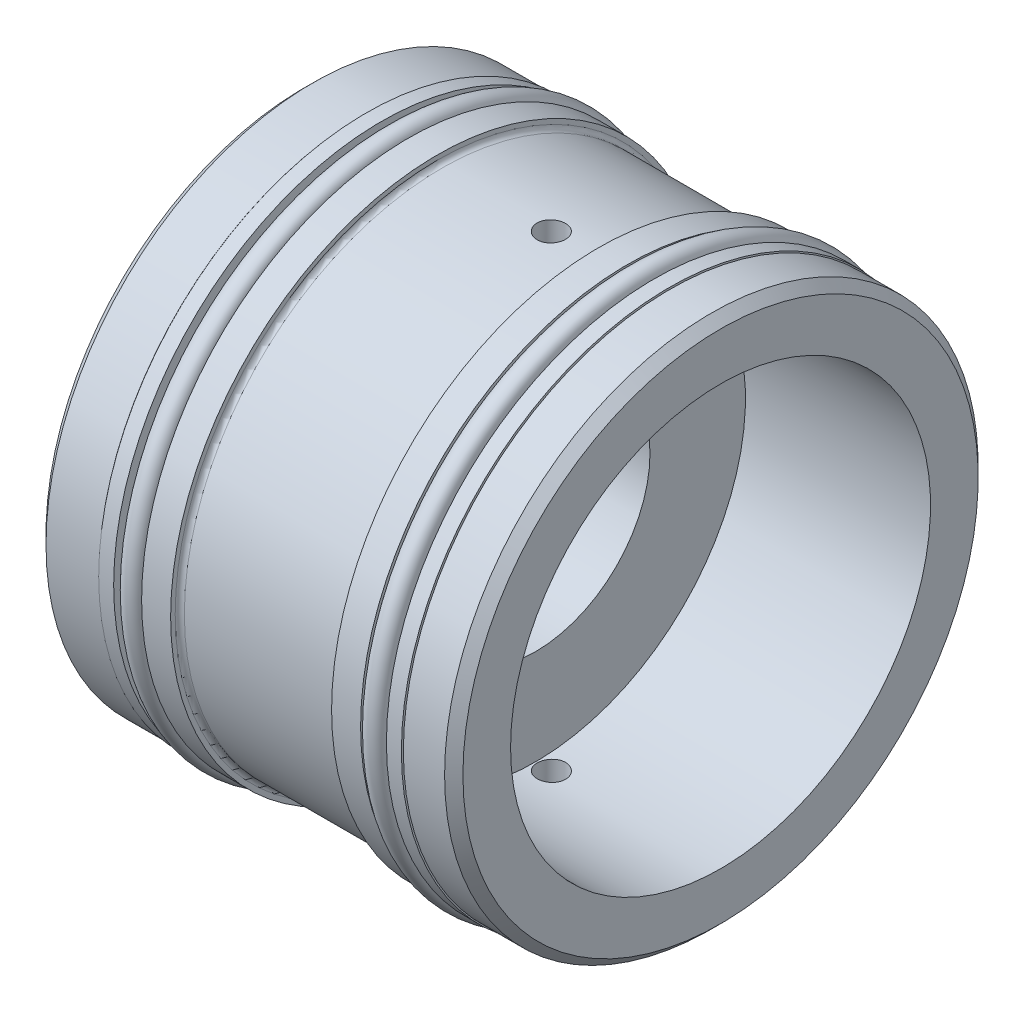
from build123d import *

# Parameters (mm, degrees)
FILLET1_R               = 0.381
CHAMFER1_SIZE           = 0.762
SKETCH6_R               = 0.889
SKETCH6_W               = 1.2446
SKETCH6_H               = 1.3462
CUT_EXTRUDE1_DEPTH      = 37.398902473
CUT_EXTRUDE1_DEPTH_BACK = 37.398902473
SKETCH7_R               = 1.1811


with BuildPart() as part:
    # Sketch1 → Revolve1 (revolve)
    with BuildSketch(Plane.XY, mode=Mode.PRIVATE) as revolve1_sk:
        Polygon((-17.3355, 9.525), (-17.3355, 22.1869), (-12.1793, 22.1869), (-12.1793, 20.9296), (-8.6233, 20.9296), (-8.6233, 22.1869), (-6.2103, 22.1869), (-6.2103, 21.4249), (7.1755, 21.4249), (7.1755, 22.1869), (9.5885, 22.1869), (9.5885, 20.9296), (13.1445, 20.9296), (13.1445, 22.1869), (17.3355, 22.1869), (17.3355, 17.4625), (1.9431, 17.4625), (1.9431, 9.525), align=None)
    revolve(revolve1_sk.sketch.rotate(Axis((0, 0, 0), (1, 0, 0)), 90), axis=Axis((0, 0, 0), (1, 0, 0)))

    # Fillet1
    fillet1_edges = [part.edges().sort_by_distance(p)[0] for p in [
        (-6.2103, 0, -21.4249),
        (7.1755, 0, -21.4249),
    ]]
    fillet(fillet1_edges, radius=FILLET1_R)

    # Chamfer1
    chamfer1_edges = [part.edges().sort_by_distance(p)[0] for p in [
        (-17.3355, 0, -22.1869),
        (17.3355, 0, -22.1869),
    ]]
    chamfer(chamfer1_edges, length=CHAMFER1_SIZE)

    # Sketch6 → Revolve3 (revolve)
    with BuildSketch(Plane.XY, mode=Mode.PRIVATE) as revolve3_sk:
        with Locations((-9.5885, 21.7424)):
            Circle(SKETCH6_R)
        with Locations((10.5537, 21.7424)):
            Circle(SKETCH6_R)
        with Locations((-11.4808, 21.6027)):
            Rectangle(SKETCH6_W, SKETCH6_H)
        with Locations((12.446, 21.6027)):
            Rectangle(SKETCH6_W, SKETCH6_H)
    revolve(revolve3_sk.sketch.rotate(Axis((0, 0, 0), (1, 0, 0)), 90), axis=Axis((0, 0, 0), (1, 0, 0)))

    # Sketch7 → Cut-Extrude1 (cut, two sides: drawn at the far end of the back side and taken through both)
    with BuildSketch(Plane(origin=(0, 0, 0), x_dir=(0, 0, -1), z_dir=(0, 1, 0)).offset(-CUT_EXTRUDE1_DEPTH_BACK)):
        with Locations(Location((0, -3.2639, 0), (0, 0, 180))):
            Circle(SKETCH7_R)
    extrude(amount=CUT_EXTRUDE1_DEPTH + CUT_EXTRUDE1_DEPTH_BACK, mode=Mode.SUBTRACT)


solid = part.part
